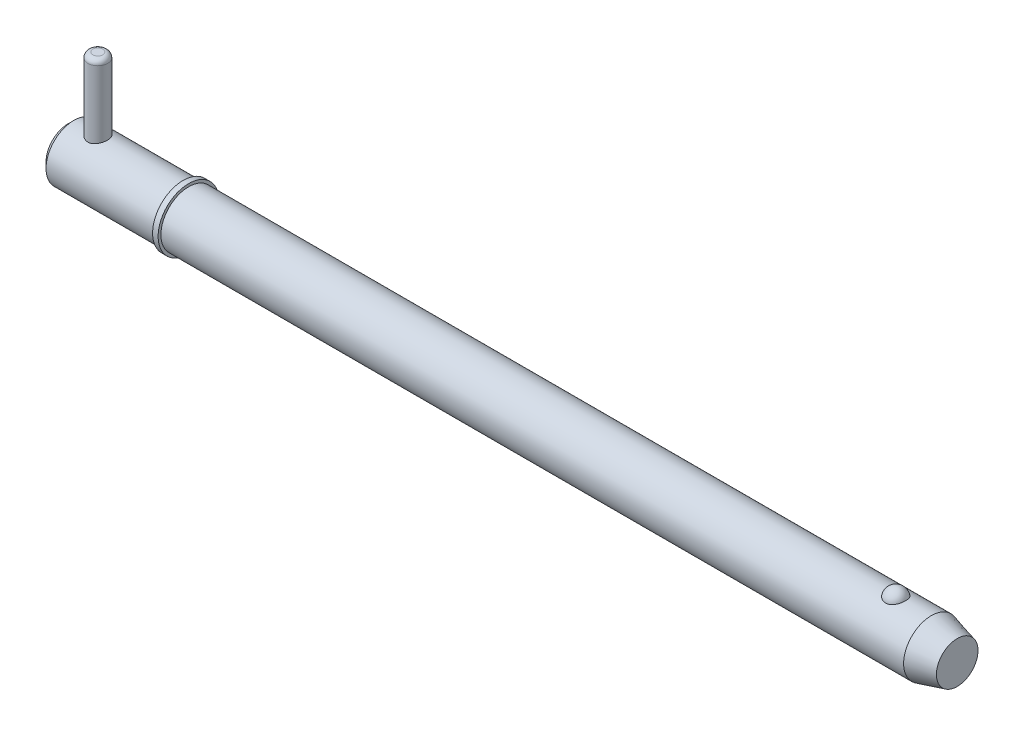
ISO-10303-21;
HEADER;
FILE_DESCRIPTION(('STEP AP214'),'2;1');
FILE_NAME('part.step','',(''),(''),'','','');
FILE_SCHEMA(('AUTOMOTIVE_DESIGN { 1 0 10303 214 1 1 1 1 }'));
ENDSEC;
DATA;
#1=APPLICATION_CONTEXT('core data for automotive mechanical design processes');
#2=APPLICATION_PROTOCOL_DEFINITION('international standard','automotive_design',2000,#1);
#3=PRODUCT_CONTEXT('',#1,'mechanical');
#4=PRODUCT('Part','Part','',(#3));
#5=PRODUCT_RELATED_PRODUCT_CATEGORY('part','',(#4));
#6=PRODUCT_DEFINITION_FORMATION('','',#4);
#7=PRODUCT_DEFINITION_CONTEXT('part definition',#1,'design');
#8=PRODUCT_DEFINITION('design','',#6,#7);
#9=PRODUCT_DEFINITION_SHAPE('','',#8);
#10=(LENGTH_UNIT() NAMED_UNIT(*) SI_UNIT(.MILLI.,.METRE.));
#11=(NAMED_UNIT(*) PLANE_ANGLE_UNIT() SI_UNIT($,.RADIAN.));
#12=(NAMED_UNIT(*) SI_UNIT($,.STERADIAN.) SOLID_ANGLE_UNIT());
#13=UNCERTAINTY_MEASURE_WITH_UNIT(LENGTH_MEASURE(1.E-05),#10,'distance_accuracy_value','');
#14=(GEOMETRIC_REPRESENTATION_CONTEXT(3) GLOBAL_UNCERTAINTY_ASSIGNED_CONTEXT((#13)) GLOBAL_UNIT_ASSIGNED_CONTEXT((#10,
#11,#12)) REPRESENTATION_CONTEXT('',''));
#15=CARTESIAN_POINT('',(0.,0.,0.));
#16=DIRECTION('',(0.,0.,1.));
#17=DIRECTION('',(1.,0.,0.));
#18=AXIS2_PLACEMENT_3D('',#15,#16,#17);
#19=CARTESIAN_POINT('',(5.94,19.845,0.));
#20=DIRECTION('',(0.,-1.,0.));
#21=DIRECTION('',(0.,0.,-1.));
#22=AXIS2_PLACEMENT_3D('',#19,#20,#21);
#23=CYLINDRICAL_SURFACE('',#22,1.98);
#24=CARTESIAN_POINT('',(5.94,-4.565,0.));
#25=DIRECTION('',(0.,1.,0.));
#26=DIRECTION('',(0.,0.,1.));
#27=AXIS2_PLACEMENT_3D('',#24,#25,#26);
#28=CIRCLE('',#27,1.98);
#29=CARTESIAN_POINT('',(5.94,-4.565,1.98));
#30=VERTEX_POINT('',#29);
#31=EDGE_CURVE('P0_E25',#30,#30,#28,.T.);
#32=ORIENTED_EDGE('',*,*,#31,.T.);
#33=EDGE_LOOP('',(#32));
#34=FACE_BOUND('',#33,.T.);
#35=CARTESIAN_POINT('',(5.94,18.855,0.));
#36=DIRECTION('',(0.,1.,0.));
#37=DIRECTION('',(0.,0.,1.));
#38=AXIS2_PLACEMENT_3D('',#35,#36,#37);
#39=CIRCLE('',#38,1.98);
#40=CARTESIAN_POINT('',(5.94,18.855,1.98));
#41=VERTEX_POINT('',#40);
#42=EDGE_CURVE('P0_E29',#41,#41,#39,.F.);
#43=ORIENTED_EDGE('',*,*,#42,.T.);
#44=EDGE_LOOP('',(#43));
#45=FACE_BOUND('',#44,.T.);
#46=ADVANCED_FACE('P0_F14',(#34,#45),#23,.T.);
#47=CARTESIAN_POINT('',(5.94,19.845,0.));
#48=DIRECTION('',(0.,1.,0.));
#49=DIRECTION('',(0.,0.,1.));
#50=AXIS2_PLACEMENT_3D('',#47,#48,#49);
#51=PLANE('',#50);
#52=CARTESIAN_POINT('',(5.94,19.845,0.));
#53=DIRECTION('',(0.,1.,0.));
#54=DIRECTION('',(0.,0.,1.));
#55=AXIS2_PLACEMENT_3D('',#52,#53,#54);
#56=CIRCLE('',#55,0.99);
#57=CARTESIAN_POINT('',(5.94,19.845,0.99));
#58=VERTEX_POINT('',#57);
#59=EDGE_CURVE('P0_E10',#58,#58,#56,.T.);
#60=ORIENTED_EDGE('',*,*,#59,.T.);
#61=EDGE_LOOP('',(#60));
#62=FACE_BOUND('',#61,.T.);
#63=ADVANCED_FACE('P0_F46',(#62),#51,.T.);
#64=CARTESIAN_POINT('',(5.94,-5.555,0.));
#65=DIRECTION('',(0.,1.,0.));
#66=DIRECTION('',(0.,0.,1.));
#67=AXIS2_PLACEMENT_3D('',#64,#65,#66);
#68=PLANE('',#67);
#69=CARTESIAN_POINT('',(5.94,-5.555,0.));
#70=DIRECTION('',(0.,1.,0.));
#71=DIRECTION('',(0.,0.,1.));
#72=AXIS2_PLACEMENT_3D('',#69,#70,#71);
#73=CIRCLE('',#72,0.99);
#74=CARTESIAN_POINT('',(5.94,-5.555,0.99));
#75=VERTEX_POINT('',#74);
#76=EDGE_CURVE('P0_E21',#75,#75,#73,.F.);
#77=ORIENTED_EDGE('',*,*,#76,.T.);
#78=EDGE_LOOP('',(#77));
#79=FACE_BOUND('',#78,.T.);
#80=ADVANCED_FACE('P0_F43',(#79),#68,.F.);
#81=CARTESIAN_POINT('',(5.94,-4.565,0.));
#82=DIRECTION('',(0.,1.,0.));
#83=DIRECTION('',(0.,0.,1.));
#84=AXIS2_PLACEMENT_3D('',#81,#82,#83);
#85=DEGENERATE_TOROIDAL_SURFACE('',#84,0.99,0.99,.T.);
#86=ORIENTED_EDGE('',*,*,#76,.F.);
#87=EDGE_LOOP('',(#86));
#88=FACE_BOUND('',#87,.T.);
#89=ORIENTED_EDGE('',*,*,#31,.F.);
#90=EDGE_LOOP('',(#89));
#91=FACE_BOUND('',#90,.T.);
#92=ADVANCED_FACE('P0_F38',(#88,#91),#85,.T.);
#93=CARTESIAN_POINT('',(5.94,18.855,0.));
#94=DIRECTION('',(0.,1.,0.));
#95=DIRECTION('',(0.,0.,1.));
#96=AXIS2_PLACEMENT_3D('',#93,#94,#95);
#97=DEGENERATE_TOROIDAL_SURFACE('',#96,0.99,0.99,.T.);
#98=ORIENTED_EDGE('',*,*,#42,.F.);
#99=EDGE_LOOP('',(#98));
#100=FACE_BOUND('',#99,.T.);
#101=ORIENTED_EDGE('',*,*,#59,.F.);
#102=EDGE_LOOP('',(#101));
#103=FACE_BOUND('',#102,.T.);
#104=ADVANCED_FACE('P0_F16',(#100,#103),#97,.T.);
#105=CLOSED_SHELL('',(#46,#63,#80,#92,#104));
#106=MANIFOLD_SOLID_BREP('P0_B1',#105);
#107=CARTESIAN_POINT('',(0.,0.,0.));
#108=DIRECTION('',(1.,0.,0.));
#109=DIRECTION('',(0.,0.,-1.));
#110=AXIS2_PLACEMENT_3D('',#107,#108,#109);
#111=CYLINDRICAL_SURFACE('',#110,5.555);
#112=CARTESIAN_POINT('',(172.917114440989,0.,0.));
#113=DIRECTION('',(1.,0.,0.));
#114=DIRECTION('',(0.,0.,-1.));
#115=AXIS2_PLACEMENT_3D('',#112,#113,#114);
#116=CIRCLE('',#115,5.555);
#117=CARTESIAN_POINT('',(172.917114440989,0.,-5.555));
#118=VERTEX_POINT('',#117);
#119=EDGE_CURVE('P1_E81',#118,#118,#116,.T.);
#120=ORIENTED_EDGE('',*,*,#119,.F.);
#121=EDGE_LOOP('',(#120));
#122=FACE_BOUND('',#121,.T.);
#123=CARTESIAN_POINT('',(24.13,0.,0.));
#124=DIRECTION('',(1.,0.,0.));
#125=DIRECTION('',(0.,0.,-1.));
#126=AXIS2_PLACEMENT_3D('',#123,#124,#125);
#127=CIRCLE('',#126,5.555);
#128=CARTESIAN_POINT('',(24.13,0.,-5.555));
#129=VERTEX_POINT('',#128);
#130=EDGE_CURVE('P1_E85',#129,#129,#127,.T.);
#131=ORIENTED_EDGE('',*,*,#130,.T.);
#132=EDGE_LOOP('',(#131));
#133=FACE_BOUND('',#132,.T.);
#134=CARTESIAN_POINT('',(165.798626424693,5.16741224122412,2.03859650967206));
#135=CARTESIAN_POINT('',(165.692949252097,5.16740893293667,2.03859990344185));
#136=CARTESIAN_POINT('',(165.58729894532,5.17079470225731,2.03008306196));
#137=CARTESIAN_POINT('',(165.379141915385,5.18392795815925,1.99630721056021));
#138=CARTESIAN_POINT('',(165.276634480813,5.19367399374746,1.97105201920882));
#139=CARTESIAN_POINT('',(165.077771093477,5.21839168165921,1.9046399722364));
#140=CARTESIAN_POINT('',(164.981406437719,5.23335573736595,1.8635062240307));
#141=CARTESIAN_POINT('',(164.797080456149,5.26688076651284,1.76652592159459));
#142=CARTESIAN_POINT('',(164.709120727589,5.28544242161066,1.71067657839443));
#143=CARTESIAN_POINT('',(164.541265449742,5.32479845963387,1.58399959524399));
#144=CARTESIAN_POINT('',(164.46166564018,5.34564089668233,1.51279545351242));
#145=CARTESIAN_POINT('',(164.31512901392,5.38697258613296,1.35828584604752));
#146=CARTESIAN_POINT('',(164.248194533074,5.40746177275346,1.27497815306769));
#147=CARTESIAN_POINT('',(164.12561039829,5.44694508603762,1.0944029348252));
#148=CARTESIAN_POINT('',(164.070598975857,5.46583143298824,0.996677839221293));
#149=CARTESIAN_POINT('',(163.976937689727,5.49908030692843,0.792961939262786));
#150=CARTESIAN_POINT('',(163.938289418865,5.513442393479,0.686970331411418));
#151=CARTESIAN_POINT('',(163.877680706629,5.53635851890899,0.468019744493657));
#152=CARTESIAN_POINT('',(163.855972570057,5.54482455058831,0.354981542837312));
#153=CARTESIAN_POINT('',(163.830636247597,5.55473324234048,0.12659586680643));
#154=CARTESIAN_POINT('',(163.827007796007,5.55617600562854,0.0112484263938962));
#155=CARTESIAN_POINT('',(163.837881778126,5.55189984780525,-0.218011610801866));
#156=CARTESIAN_POINT('',(163.852315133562,5.54620821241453,-0.331928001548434));
#157=CARTESIAN_POINT('',(163.898903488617,5.52828920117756,-0.555544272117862));
#158=CARTESIAN_POINT('',(163.931058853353,5.5160616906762,-0.665244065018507));
#159=CARTESIAN_POINT('',(164.012488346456,5.48630779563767,-0.877469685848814));
#160=CARTESIAN_POINT('',(164.061781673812,5.4687754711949,-0.979987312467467));
#161=CARTESIAN_POINT('',(164.176478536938,5.43024700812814,-1.17486975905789));
#162=CARTESIAN_POINT('',(164.241883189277,5.4092506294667,-1.26723387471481));
#163=CARTESIAN_POINT('',(164.387571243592,5.36600927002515,-1.4394013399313));
#164=CARTESIAN_POINT('',(164.467885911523,5.34376173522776,-1.51917763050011));
#165=CARTESIAN_POINT('',(164.641452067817,5.30057971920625,-1.66360338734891));
#166=CARTESIAN_POINT('',(164.734702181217,5.27964509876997,-1.72825445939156));
#167=CARTESIAN_POINT('',(164.929393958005,5.24205250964,-1.83909478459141));
#168=CARTESIAN_POINT('',(165.030590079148,5.22530519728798,-1.88568407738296));
#169=CARTESIAN_POINT('',(165.240155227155,5.19750919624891,-1.96100802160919));
#170=CARTESIAN_POINT('',(165.348521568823,5.1864583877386,-1.98974931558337));
#171=CARTESIAN_POINT('',(165.563498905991,5.17184410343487,-2.02742262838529));
#172=CARTESIAN_POINT('',(165.669925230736,5.1679328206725,-2.03727608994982));
#173=CARTESIAN_POINT('',(165.882992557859,5.16698995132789,-2.03966777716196));
#174=CARTESIAN_POINT('',(165.989633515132,5.16995704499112,-2.0322093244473));
#175=CARTESIAN_POINT('',(166.196773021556,5.18222383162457,-2.00071170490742));
#176=CARTESIAN_POINT('',(166.297359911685,5.19133213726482,-1.97717337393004));
#177=CARTESIAN_POINT('',(166.493014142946,5.21467637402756,-1.91475248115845));
#178=CARTESIAN_POINT('',(166.588081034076,5.22891272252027,-1.87586867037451));
#179=CARTESIAN_POINT('',(166.772371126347,5.26137066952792,-1.78282713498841));
#180=CARTESIAN_POINT('',(166.861419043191,5.27967329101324,-1.72835124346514));
#181=CARTESIAN_POINT('',(167.029288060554,5.3181741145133,-1.60597483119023));
#182=CARTESIAN_POINT('',(167.108106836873,5.33837274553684,-1.5380712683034));
#183=CARTESIAN_POINT('',(167.257515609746,5.37968287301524,-1.38688970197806));
#184=CARTESIAN_POINT('',(167.327505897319,5.40079011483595,-1.30301744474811));
#185=CARTESIAN_POINT('',(167.453012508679,5.44074401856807,-1.12458170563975));
#186=CARTESIAN_POINT('',(167.508526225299,5.45959027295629,-1.03001630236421));
#187=CARTESIAN_POINT('',(167.605550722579,5.49369849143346,-0.829439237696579));
#188=CARTESIAN_POINT('',(167.646548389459,5.50882422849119,-0.723155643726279));
#189=CARTESIAN_POINT('',(167.711125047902,5.53310911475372,-0.504772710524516));
#190=CARTESIAN_POINT('',(167.734703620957,5.54226812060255,-0.392673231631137));
#191=CARTESIAN_POINT('',(167.764013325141,5.55370358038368,-0.165459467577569));
#192=CARTESIAN_POINT('',(167.769688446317,5.55595843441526,-0.0503368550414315));
#193=CARTESIAN_POINT('',(167.762916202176,5.55329317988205,0.179288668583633));
#194=CARTESIAN_POINT('',(167.750469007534,5.54837313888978,0.293791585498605));
#195=CARTESIAN_POINT('',(167.707779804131,5.53189037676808,0.51852641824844));
#196=CARTESIAN_POINT('',(167.677598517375,5.5203503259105,0.62877154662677));
#197=CARTESIAN_POINT('',(167.600096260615,5.49182453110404,0.842318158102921));
#198=CARTESIAN_POINT('',(167.552774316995,5.47483847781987,0.945619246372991));
#199=CARTESIAN_POINT('',(167.441720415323,5.43710633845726,1.14281571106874));
#200=CARTESIAN_POINT('',(167.377921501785,5.41634501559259,1.23667048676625));
#201=CARTESIAN_POINT('',(167.235357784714,5.37334572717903,1.4118524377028));
#202=CARTESIAN_POINT('',(167.15659323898,5.35110778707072,1.49317982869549));
#203=CARTESIAN_POINT('',(166.986423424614,5.30779474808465,1.64049162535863));
#204=CARTESIAN_POINT('',(166.89510026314,5.28671324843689,1.70656877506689));
#205=CARTESIAN_POINT('',(166.701739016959,5.2480485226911,1.82201372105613));
#206=CARTESIAN_POINT('',(166.599700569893,5.23046541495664,1.87138095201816));
#207=CARTESIAN_POINT('',(166.383618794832,5.20042692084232,1.95335298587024));
#208=CARTESIAN_POINT('',(166.269260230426,5.18820192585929,1.98521734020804));
#209=CARTESIAN_POINT('',(166.036130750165,5.17169804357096,2.02783294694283));
#210=CARTESIAN_POINT('',(165.917361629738,5.16741595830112,2.03859269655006));
#211=CARTESIAN_POINT('',(165.798626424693,5.16741224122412,2.03859650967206));
#212=B_SPLINE_CURVE_WITH_KNOTS('',3,(#134,#135,#136,#137,#138,#139,#140,#141,#142,#143,#144,
#145,#146,#147,#148,#149,#150,#151,#152,#153,#154,#155,#156,#157,#158,#159,#160,#161,#162,#163,
#164,#165,#166,#167,#168,#169,#170,#171,#172,#173,#174,#175,#176,#177,#178,#179,#180,#181,#182,
#183,#184,#185,#186,#187,#188,#189,#190,#191,#192,#193,#194,#195,#196,#197,#198,#199,#200,#201,
#202,#203,#204,#205,#206,#207,#208,#209,#210,#211),.UNSPECIFIED.,.T.,.F.,(4,2,2,2,2,2,2,2,2,2,2,
2,2,2,2,2,2,2,2,2,2,2,2,2,2,2,2,2,2,2,2,2,2,2,2,2,2,2,4),(0.,0.316595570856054,
0.633118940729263,0.94918341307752,1.26530783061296,1.59030762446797,1.91536729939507,
2.25495824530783,2.59458224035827,2.93917283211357,3.28375835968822,3.62703002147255,
3.97030875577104,4.31397329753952,4.657661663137,5.00207904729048,5.34645984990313,
5.68270547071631,6.01882587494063,6.33808403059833,6.65728093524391,6.9669637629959,
7.27667180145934,7.59321535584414,7.90983070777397,8.24210387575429,8.57443684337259,
8.91755896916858,9.26068933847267,9.60489211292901,9.94909164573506,10.2921194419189,
10.6351667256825,10.9796305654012,11.3240884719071,11.6663928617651,12.0087088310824,
12.3645679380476,12.7202837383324),.UNSPECIFIED.);
#213=CARTESIAN_POINT('',(165.798626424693,5.16741224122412,2.03859650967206));
#214=VERTEX_POINT('',#213);
#215=EDGE_CURVE('P1_E35',#214,#214,#212,.T.);
#216=ORIENTED_EDGE('',*,*,#215,.T.);
#217=EDGE_LOOP('',(#216));
#218=FACE_BOUND('',#217,.T.);
#219=ADVANCED_FACE('P1_F13',(#122,#133,#218),#111,.T.);
#220=CARTESIAN_POINT('',(0.,0.,0.));
#221=DIRECTION('',(-1.,0.,0.));
#222=DIRECTION('',(0.,0.,1.));
#223=AXIS2_PLACEMENT_3D('',#220,#221,#222);
#224=PLANE('',#223);
#225=CARTESIAN_POINT('',(0.,0.,0.));
#226=DIRECTION('',(1.,0.,0.));
#227=DIRECTION('',(0.,0.,-1.));
#228=AXIS2_PLACEMENT_3D('',#225,#226,#227);
#229=CIRCLE('',#228,4.444);
#230=CARTESIAN_POINT('',(0.,0.,-4.444));
#231=VERTEX_POINT('',#230);
#232=EDGE_CURVE('P1_E9',#231,#231,#229,.T.);
#233=ORIENTED_EDGE('',*,*,#232,.F.);
#234=EDGE_LOOP('',(#233));
#235=FACE_BOUND('',#234,.T.);
#236=ADVANCED_FACE('P1_F15',(#235),#224,.T.);
#237=CARTESIAN_POINT('',(1.111,0.,0.));
#238=DIRECTION('',(1.,0.,0.));
#239=DIRECTION('',(0.,0.,-1.));
#240=AXIS2_PLACEMENT_3D('',#237,#238,#239);
#241=CONICAL_SURFACE('',#240,5.555,0.78539816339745);
#242=ORIENTED_EDGE('',*,*,#232,.T.);
#243=EDGE_LOOP('',(#242));
#244=FACE_BOUND('',#243,.T.);
#245=CARTESIAN_POINT('',(1.111,0.,0.));
#246=DIRECTION('',(1.,0.,0.));
#247=DIRECTION('',(0.,0.,-1.));
#248=AXIS2_PLACEMENT_3D('',#245,#246,#247);
#249=CIRCLE('',#248,5.555);
#250=CARTESIAN_POINT('',(1.111,0.,-5.555));
#251=VERTEX_POINT('',#250);
#252=EDGE_CURVE('P1_E26',#251,#251,#249,.T.);
#253=ORIENTED_EDGE('',*,*,#252,.F.);
#254=EDGE_LOOP('',(#253));
#255=FACE_BOUND('',#254,.T.);
#256=ADVANCED_FACE('P1_F77',(#244,#255),#241,.T.);
#257=CARTESIAN_POINT('',(0.,0.,0.));
#258=DIRECTION('',(1.,0.,0.));
#259=DIRECTION('',(0.,0.,-1.));
#260=AXIS2_PLACEMENT_3D('',#257,#258,#259);
#261=CYLINDRICAL_SURFACE('',#260,5.555);
#262=CARTESIAN_POINT('',(5.94,-5.19014691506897,1.98));
#263=CARTESIAN_POINT('',(5.83264687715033,-5.19014494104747,1.98000226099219));
#264=CARTESIAN_POINT('',(5.7253094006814,-5.19351395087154,1.97123988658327));
#265=CARTESIAN_POINT('',(5.51384517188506,-5.20654291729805,1.93656219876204));
#266=CARTESIAN_POINT('',(5.40971858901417,-5.21620320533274,1.91064598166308));
#267=CARTESIAN_POINT('',(5.20778082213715,-5.24058443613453,1.84271148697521));
#268=CARTESIAN_POINT('',(5.10995634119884,-5.25529427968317,1.80072850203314));
#269=CARTESIAN_POINT('',(4.92270352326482,-5.28810012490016,1.70197537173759));
#270=CARTESIAN_POINT('',(4.83327743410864,-5.3061970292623,1.64520128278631));
#271=CARTESIAN_POINT('',(4.66135184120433,-5.34464714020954,1.51575187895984));
#272=CARTESIAN_POINT('',(4.57928277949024,-5.36506222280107,1.44252311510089));
#273=CARTESIAN_POINT('',(4.42829115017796,-5.40532920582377,1.28342047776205));
#274=CARTESIAN_POINT('',(4.35937105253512,-5.42518099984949,1.19754423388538));
#275=CARTESIAN_POINT('',(4.23461605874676,-5.46281133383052,1.01237205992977));
#276=CARTESIAN_POINT('',(4.17924129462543,-5.48050875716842,0.912748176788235));
#277=CARTESIAN_POINT('',(4.0862117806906,-5.51109938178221,0.70485824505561));
#278=CARTESIAN_POINT('',(4.0485515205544,-5.52399407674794,0.596594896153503));
#279=CARTESIAN_POINT('',(3.99350662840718,-5.54308759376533,0.379019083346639));
#280=CARTESIAN_POINT('',(3.97538263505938,-5.54952987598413,0.269915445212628));
#281=CARTESIAN_POINT('',(3.95756405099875,-5.55586205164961,0.0500378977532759));
#282=CARTESIAN_POINT('',(3.95786404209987,-5.55575387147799,-0.060735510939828));
#283=CARTESIAN_POINT('',(3.97643665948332,-5.54915684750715,-0.275539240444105));
#284=CARTESIAN_POINT('',(3.99390415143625,-5.54295384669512,-0.379649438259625));
#285=CARTESIAN_POINT('',(4.0449721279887,-5.52523170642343,-0.583350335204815));
#286=CARTESIAN_POINT('',(4.07857373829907,-5.51371219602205,-0.682940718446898));
#287=CARTESIAN_POINT('',(4.16137312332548,-5.4863099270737,-0.876423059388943));
#288=CARTESIAN_POINT('',(4.2107826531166,-5.47036834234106,-0.970215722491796));
#289=CARTESIAN_POINT('',(4.32361427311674,-5.43575653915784,-1.1484017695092));
#290=CARTESIAN_POINT('',(4.38704062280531,-5.41708549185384,-1.23279228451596));
#291=CARTESIAN_POINT('',(4.53006791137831,-5.37778429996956,-1.39454579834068));
#292=CARTESIAN_POINT('',(4.61035105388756,-5.35710277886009,-1.4712940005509));
#293=CARTESIAN_POINT('',(4.78279835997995,-5.31692766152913,-1.6104545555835));
#294=CARTESIAN_POINT('',(4.874964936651,-5.29743430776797,-1.67286398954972));
#295=CARTESIAN_POINT('',(5.07076688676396,-5.26153775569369,-1.78259698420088));
#296=CARTESIAN_POINT('',(5.17458163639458,-5.24519780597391,-1.8296227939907));
#297=CARTESIAN_POINT('',(5.38938990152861,-5.21818744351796,-1.90530278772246));
#298=CARTESIAN_POINT('',(5.50037985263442,-5.20751423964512,-1.93396601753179));
#299=CARTESIAN_POINT('',(5.72036376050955,-5.19369176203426,-1.97077654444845));
#300=CARTESIAN_POINT('',(5.82917370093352,-5.19018851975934,-1.97989015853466));
#301=CARTESIAN_POINT('',(6.04680100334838,-5.19010609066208,-1.98010779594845));
#302=CARTESIAN_POINT('',(6.15561835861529,-5.19352540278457,-1.97121572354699));
#303=CARTESIAN_POINT('',(6.36548036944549,-5.20654623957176,-1.93654727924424));
#304=CARTESIAN_POINT('',(6.46666051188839,-5.21588705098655,-1.91148218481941));
#305=CARTESIAN_POINT('',(6.66334537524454,-5.23939939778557,-1.84605494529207));
#306=CARTESIAN_POINT('',(6.75884899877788,-5.25357186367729,-1.8056898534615));
#307=CARTESIAN_POINT('',(6.94517989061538,-5.28576258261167,-1.70921153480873));
#308=CARTESIAN_POINT('',(7.03572661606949,-5.30389804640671,-1.65259670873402));
#309=CARTESIAN_POINT('',(7.20638087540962,-5.34176077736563,-1.52577523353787));
#310=CARTESIAN_POINT('',(7.28648490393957,-5.36148857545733,-1.45556404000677));
#311=CARTESIAN_POINT('',(7.43864697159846,-5.40165494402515,-1.2988614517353));
#312=CARTESIAN_POINT('',(7.50999887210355,-5.42207106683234,-1.21167640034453));
#313=CARTESIAN_POINT('',(7.63712639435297,-5.46023601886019,-1.026066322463));
#314=CARTESIAN_POINT('',(7.69290228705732,-5.47798489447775,-0.927641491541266));
#315=CARTESIAN_POINT('',(7.78684673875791,-5.50876590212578,-0.722633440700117));
#316=CARTESIAN_POINT('',(7.82510508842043,-5.52182201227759,-0.616095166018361));
#317=CARTESIAN_POINT('',(7.88297051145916,-5.54184206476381,-0.397530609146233));
#318=CARTESIAN_POINT('',(7.90258540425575,-5.5488085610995,-0.285506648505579));
#319=CARTESIAN_POINT('',(7.9218262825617,-5.55564472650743,-0.065566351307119));
#320=CARTESIAN_POINT('',(7.92245987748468,-5.55587212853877,0.0422515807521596));
#321=CARTESIAN_POINT('',(7.90626329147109,-5.55011340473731,0.256387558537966));
#322=CARTESIAN_POINT('',(7.88943488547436,-5.54412791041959,0.362705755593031));
#323=CARTESIAN_POINT('',(7.83948457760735,-5.52676548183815,0.568649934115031));
#324=CARTESIAN_POINT('',(7.8067003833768,-5.51550046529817,0.668367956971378));
#325=CARTESIAN_POINT('',(7.72609369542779,-5.48874437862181,0.860911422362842));
#326=CARTESIAN_POINT('',(7.67826838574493,-5.47325251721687,0.953735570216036));
#327=CARTESIAN_POINT('',(7.56675024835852,-5.43884382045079,1.13391068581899));
#328=CARTESIAN_POINT('',(7.50249968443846,-5.41981485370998,1.22089468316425));
#329=CARTESIAN_POINT('',(7.36086495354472,-5.38069275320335,1.38316665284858));
#330=CARTESIAN_POINT('',(7.28347630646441,-5.36059925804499,1.45845061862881));
#331=CARTESIAN_POINT('',(7.11347587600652,-5.32048380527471,1.59876646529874));
#332=CARTESIAN_POINT('',(7.02032386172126,-5.30050854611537,1.66315951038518));
#333=CARTESIAN_POINT('',(6.82388804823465,-5.26398994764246,1.77536801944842));
#334=CARTESIAN_POINT('',(6.7206049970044,-5.24744635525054,1.82318470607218));
#335=CARTESIAN_POINT('',(6.50639706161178,-5.21987969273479,1.90068230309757));
#336=CARTESIAN_POINT('',(6.3954529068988,-5.20887116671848,1.93031547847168));
#337=CARTESIAN_POINT('',(6.16966522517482,-5.19400760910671,1.96996824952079));
#338=CARTESIAN_POINT('',(6.05482366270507,-5.19014902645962,1.97999758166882));
#339=CARTESIAN_POINT('',(5.94,-5.19014691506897,1.98));
#340=B_SPLINE_CURVE_WITH_KNOTS('',3,(#262,#263,#264,#265,#266,#267,#268,#269,#270,#271,#272,
#273,#274,#275,#276,#277,#278,#279,#280,#281,#282,#283,#284,#285,#286,#287,#288,#289,#290,#291,
#292,#293,#294,#295,#296,#297,#298,#299,#300,#301,#302,#303,#304,#305,#306,#307,#308,#309,#310,
#311,#312,#313,#314,#315,#316,#317,#318,#319,#320,#321,#322,#323,#324,#325,#326,#327,#328,#329,
#330,#331,#332,#333,#334,#335,#336,#337,#338,#339),.UNSPECIFIED.,.T.,.F.,(4,2,2,2,2,2,2,2,2,2,2,
2,2,2,2,2,2,2,2,2,2,2,2,2,2,2,2,2,2,2,2,2,2,2,2,2,2,2,4),(0.,0.321632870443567,
0.643282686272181,0.964229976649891,1.28526292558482,1.61937087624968,1.9535415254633,
2.29784481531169,2.64204093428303,2.97269632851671,3.30325448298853,3.61901541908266,
3.93479838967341,4.25500220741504,4.57530346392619,4.91268648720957,5.25013812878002,
5.59378026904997,5.93725299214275,6.26331481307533,6.58930593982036,6.90185604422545,
7.21446637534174,7.53801472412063,7.86167140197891,8.20353561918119,8.54539388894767,
8.88547970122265,9.22542281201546,9.54728637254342,9.86911722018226,10.1844146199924,
10.4997710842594,10.827730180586,11.1558013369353,11.499115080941,11.8424034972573,
12.1865892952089,12.5306041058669),.UNSPECIFIED.);
#341=CARTESIAN_POINT('',(5.94,-5.19014691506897,1.98));
#342=VERTEX_POINT('',#341);
#343=EDGE_CURVE('P1_E17',#342,#342,#340,.T.);
#344=ORIENTED_EDGE('',*,*,#343,.F.);
#345=EDGE_LOOP('',(#344));
#346=FACE_BOUND('',#345,.T.);
#347=CARTESIAN_POINT('',(5.94,5.19014691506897,1.98));
#348=CARTESIAN_POINT('',(6.04735312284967,5.19014494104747,1.98000226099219));
#349=CARTESIAN_POINT('',(6.1546905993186,5.19351395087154,1.97123988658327));
#350=CARTESIAN_POINT('',(6.36615482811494,5.20654291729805,1.93656219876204));
#351=CARTESIAN_POINT('',(6.47028141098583,5.21620320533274,1.91064598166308));
#352=CARTESIAN_POINT('',(6.67221917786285,5.24058443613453,1.84271148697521));
#353=CARTESIAN_POINT('',(6.77004365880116,5.25529427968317,1.80072850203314));
#354=CARTESIAN_POINT('',(6.95729647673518,5.28810012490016,1.70197537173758));
#355=CARTESIAN_POINT('',(7.04672256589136,5.3061970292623,1.64520128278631));
#356=CARTESIAN_POINT('',(7.21864815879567,5.34464714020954,1.51575187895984));
#357=CARTESIAN_POINT('',(7.30071722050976,5.36506222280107,1.44252311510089));
#358=CARTESIAN_POINT('',(7.45170884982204,5.40532920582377,1.28342047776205));
#359=CARTESIAN_POINT('',(7.52062894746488,5.42518099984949,1.19754423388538));
#360=CARTESIAN_POINT('',(7.64538394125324,5.46281133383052,1.01237205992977));
#361=CARTESIAN_POINT('',(7.70075870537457,5.48050875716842,0.912748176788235));
#362=CARTESIAN_POINT('',(7.7937882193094,5.51109938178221,0.704858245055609));
#363=CARTESIAN_POINT('',(7.8314484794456,5.52399407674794,0.596594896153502));
#364=CARTESIAN_POINT('',(7.88649337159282,5.54308759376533,0.379019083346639));
#365=CARTESIAN_POINT('',(7.90461736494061,5.54952987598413,0.269915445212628));
#366=CARTESIAN_POINT('',(7.92243594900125,5.55586205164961,0.0500378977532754));
#367=CARTESIAN_POINT('',(7.92213595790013,5.55575387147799,-0.0607355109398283));
#368=CARTESIAN_POINT('',(7.90356334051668,5.54915684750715,-0.275539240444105));
#369=CARTESIAN_POINT('',(7.88609584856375,5.54295384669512,-0.379649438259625));
#370=CARTESIAN_POINT('',(7.8350278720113,5.52523170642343,-0.583350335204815));
#371=CARTESIAN_POINT('',(7.80142626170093,5.51371219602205,-0.682940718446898));
#372=CARTESIAN_POINT('',(7.71862687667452,5.4863099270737,-0.876423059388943));
#373=CARTESIAN_POINT('',(7.6692173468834,5.47036834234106,-0.970215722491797));
#374=CARTESIAN_POINT('',(7.55638572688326,5.43575653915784,-1.1484017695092));
#375=CARTESIAN_POINT('',(7.49295937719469,5.41708549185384,-1.23279228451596));
#376=CARTESIAN_POINT('',(7.34993208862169,5.37778429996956,-1.39454579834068));
#377=CARTESIAN_POINT('',(7.26964894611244,5.35710277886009,-1.4712940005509));
#378=CARTESIAN_POINT('',(7.09720164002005,5.31692766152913,-1.6104545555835));
#379=CARTESIAN_POINT('',(7.00503506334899,5.29743430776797,-1.67286398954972));
#380=CARTESIAN_POINT('',(6.80923311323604,5.26153775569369,-1.78259698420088));
#381=CARTESIAN_POINT('',(6.70541836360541,5.24519780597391,-1.8296227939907));
#382=CARTESIAN_POINT('',(6.49061009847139,5.21818744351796,-1.90530278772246));
#383=CARTESIAN_POINT('',(6.37962014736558,5.20751423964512,-1.93396601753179));
#384=CARTESIAN_POINT('',(6.15963623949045,5.19369176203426,-1.97077654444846));
#385=CARTESIAN_POINT('',(6.05082629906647,5.19018851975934,-1.97989015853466));
#386=CARTESIAN_POINT('',(5.83319899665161,5.19010609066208,-1.98010779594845));
#387=CARTESIAN_POINT('',(5.7243816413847,5.19352540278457,-1.97121572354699));
#388=CARTESIAN_POINT('',(5.5145196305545,5.20654623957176,-1.93654727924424));
#389=CARTESIAN_POINT('',(5.4133394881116,5.21588705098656,-1.91148218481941));
#390=CARTESIAN_POINT('',(5.21665462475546,5.23939939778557,-1.84605494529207));
#391=CARTESIAN_POINT('',(5.12115100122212,5.25357186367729,-1.8056898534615));
#392=CARTESIAN_POINT('',(4.93482010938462,5.28576258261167,-1.70921153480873));
#393=CARTESIAN_POINT('',(4.84427338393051,5.30389804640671,-1.65259670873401));
#394=CARTESIAN_POINT('',(4.67361912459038,5.34176077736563,-1.52577523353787));
#395=CARTESIAN_POINT('',(4.59351509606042,5.36148857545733,-1.45556404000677));
#396=CARTESIAN_POINT('',(4.44135302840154,5.40165494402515,-1.2988614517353));
#397=CARTESIAN_POINT('',(4.37000112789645,5.42207106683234,-1.21167640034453));
#398=CARTESIAN_POINT('',(4.24287360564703,5.46023601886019,-1.026066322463));
#399=CARTESIAN_POINT('',(4.18709771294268,5.47798489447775,-0.927641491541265));
#400=CARTESIAN_POINT('',(4.09315326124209,5.50876590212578,-0.722633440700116));
#401=CARTESIAN_POINT('',(4.05489491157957,5.52182201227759,-0.61609516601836));
#402=CARTESIAN_POINT('',(3.99702948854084,5.54184206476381,-0.397530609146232));
#403=CARTESIAN_POINT('',(3.97741459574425,5.5488085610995,-0.285506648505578));
#404=CARTESIAN_POINT('',(3.9581737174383,5.55564472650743,-0.0655663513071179));
#405=CARTESIAN_POINT('',(3.95754012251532,5.55587212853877,0.0422515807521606));
#406=CARTESIAN_POINT('',(3.97373670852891,5.55011340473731,0.256387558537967));
#407=CARTESIAN_POINT('',(3.99056511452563,5.54412791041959,0.362705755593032));
#408=CARTESIAN_POINT('',(4.04051542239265,5.52676548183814,0.568649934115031));
#409=CARTESIAN_POINT('',(4.07329961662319,5.51550046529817,0.668367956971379));
#410=CARTESIAN_POINT('',(4.15390630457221,5.48874437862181,0.860911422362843));
#411=CARTESIAN_POINT('',(4.20173161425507,5.47325251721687,0.953735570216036));
#412=CARTESIAN_POINT('',(4.31324975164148,5.43884382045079,1.13391068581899));
#413=CARTESIAN_POINT('',(4.37750031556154,5.41981485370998,1.22089468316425));
#414=CARTESIAN_POINT('',(4.51913504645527,5.38069275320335,1.38316665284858));
#415=CARTESIAN_POINT('',(4.59652369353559,5.36059925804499,1.45845061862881));
#416=CARTESIAN_POINT('',(4.76652412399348,5.32048380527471,1.59876646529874));
#417=CARTESIAN_POINT('',(4.85967613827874,5.30050854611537,1.66315951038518));
#418=CARTESIAN_POINT('',(5.05611195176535,5.26398994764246,1.77536801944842));
#419=CARTESIAN_POINT('',(5.1593950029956,5.24744635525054,1.82318470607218));
#420=CARTESIAN_POINT('',(5.37360293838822,5.21987969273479,1.90068230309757));
#421=CARTESIAN_POINT('',(5.4845470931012,5.20887116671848,1.93031547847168));
#422=CARTESIAN_POINT('',(5.71033477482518,5.19400760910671,1.96996824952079));
#423=CARTESIAN_POINT('',(5.82517633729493,5.19014902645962,1.97999758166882));
#424=CARTESIAN_POINT('',(5.94,5.19014691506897,1.98));
#425=B_SPLINE_CURVE_WITH_KNOTS('',3,(#347,#348,#349,#350,#351,#352,#353,#354,#355,#356,#357,
#358,#359,#360,#361,#362,#363,#364,#365,#366,#367,#368,#369,#370,#371,#372,#373,#374,#375,#376,
#377,#378,#379,#380,#381,#382,#383,#384,#385,#386,#387,#388,#389,#390,#391,#392,#393,#394,#395,
#396,#397,#398,#399,#400,#401,#402,#403,#404,#405,#406,#407,#408,#409,#410,#411,#412,#413,#414,
#415,#416,#417,#418,#419,#420,#421,#422,#423,#424),.UNSPECIFIED.,.T.,.F.,(4,2,2,2,2,2,2,2,2,2,2,
2,2,2,2,2,2,2,2,2,2,2,2,2,2,2,2,2,2,2,2,2,2,2,2,2,2,2,4),(0.,0.321632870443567,
0.643282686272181,0.964229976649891,1.28526292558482,1.61937087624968,1.9535415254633,
2.29784481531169,2.64204093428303,2.97269632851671,3.30325448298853,3.61901541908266,
3.93479838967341,4.25500220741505,4.57530346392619,4.91268648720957,5.25013812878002,
5.59378026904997,5.93725299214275,6.26331481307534,6.58930593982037,6.90185604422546,
7.21446637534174,7.53801472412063,7.86167140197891,8.20353561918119,8.54539388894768,
8.88547970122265,9.22542281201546,9.54728637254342,9.86911722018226,10.1844146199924,
10.4997710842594,10.827730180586,11.1558013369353,11.499115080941,11.8424034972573,
12.1865892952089,12.5306041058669),.UNSPECIFIED.);
#426=CARTESIAN_POINT('',(5.94,5.19014691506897,1.98));
#427=VERTEX_POINT('',#426);
#428=EDGE_CURVE('P1_E43',#427,#427,#425,.T.);
#429=ORIENTED_EDGE('',*,*,#428,.F.);
#430=EDGE_LOOP('',(#429));
#431=FACE_BOUND('',#430,.T.);
#432=ORIENTED_EDGE('',*,*,#252,.T.);
#433=EDGE_LOOP('',(#432));
#434=FACE_BOUND('',#433,.T.);
#435=CARTESIAN_POINT('',(23.019,0.,0.));
#436=DIRECTION('',(1.,0.,0.));
#437=DIRECTION('',(0.,0.,-1.));
#438=AXIS2_PLACEMENT_3D('',#435,#436,#437);
#439=CIRCLE('',#438,5.555);
#440=CARTESIAN_POINT('',(23.019,0.,-5.555));
#441=VERTEX_POINT('',#440);
#442=EDGE_CURVE('P1_E31',#441,#441,#439,.T.);
#443=ORIENTED_EDGE('',*,*,#442,.F.);
#444=EDGE_LOOP('',(#443));
#445=FACE_BOUND('',#444,.T.);
#446=ADVANCED_FACE('P1_F103',(#346,#431,#434,#445),#261,.T.);
#447=CARTESIAN_POINT('',(23.019,5.555,0.));
#448=DIRECTION('',(-1.,0.,0.));
#449=DIRECTION('',(0.,0.,1.));
#450=AXIS2_PLACEMENT_3D('',#447,#448,#449);
#451=PLANE('',#450);
#452=ORIENTED_EDGE('',*,*,#442,.T.);
#453=EDGE_LOOP('',(#452));
#454=FACE_BOUND('',#453,.T.);
#455=CARTESIAN_POINT('',(23.019,0.,0.));
#456=DIRECTION('',(1.,0.,0.));
#457=DIRECTION('',(0.,0.,-1.));
#458=AXIS2_PLACEMENT_3D('',#455,#456,#457);
#459=CIRCLE('',#458,6.1105);
#460=CARTESIAN_POINT('',(23.019,0.,-6.1105));
#461=VERTEX_POINT('',#460);
#462=EDGE_CURVE('P1_E91',#461,#461,#459,.T.);
#463=ORIENTED_EDGE('',*,*,#462,.F.);
#464=EDGE_LOOP('',(#463));
#465=FACE_BOUND('',#464,.T.);
#466=ADVANCED_FACE('P1_F100',(#454,#465),#451,.T.);
#467=CARTESIAN_POINT('',(0.,0.,0.));
#468=DIRECTION('',(1.,0.,0.));
#469=DIRECTION('',(0.,0.,-1.));
#470=AXIS2_PLACEMENT_3D('',#467,#468,#469);
#471=CYLINDRICAL_SURFACE('',#470,6.1105);
#472=ORIENTED_EDGE('',*,*,#462,.T.);
#473=EDGE_LOOP('',(#472));
#474=FACE_BOUND('',#473,.T.);
#475=CARTESIAN_POINT('',(24.13,0.,0.));
#476=DIRECTION('',(1.,0.,0.));
#477=DIRECTION('',(0.,0.,-1.));
#478=AXIS2_PLACEMENT_3D('',#475,#476,#477);
#479=CIRCLE('',#478,6.1105);
#480=CARTESIAN_POINT('',(24.13,0.,-6.1105));
#481=VERTEX_POINT('',#480);
#482=EDGE_CURVE('P1_E88',#481,#481,#479,.T.);
#483=ORIENTED_EDGE('',*,*,#482,.F.);
#484=EDGE_LOOP('',(#483));
#485=FACE_BOUND('',#484,.T.);
#486=ADVANCED_FACE('P1_F68',(#474,#485),#471,.T.);
#487=CARTESIAN_POINT('',(24.13,6.1105,0.));
#488=DIRECTION('',(1.,0.,0.));
#489=DIRECTION('',(0.,0.,-1.));
#490=AXIS2_PLACEMENT_3D('',#487,#488,#489);
#491=PLANE('',#490);
#492=ORIENTED_EDGE('',*,*,#482,.T.);
#493=EDGE_LOOP('',(#492));
#494=FACE_BOUND('',#493,.T.);
#495=ORIENTED_EDGE('',*,*,#130,.F.);
#496=EDGE_LOOP('',(#495));
#497=FACE_BOUND('',#496,.T.);
#498=ADVANCED_FACE('P1_F62',(#494,#497),#491,.T.);
#499=CARTESIAN_POINT('',(178.1,0.,0.));
#500=DIRECTION('',(-1.,0.,0.));
#501=DIRECTION('',(0.,0.,1.));
#502=AXIS2_PLACEMENT_3D('',#499,#500,#501);
#503=CONICAL_SURFACE('',#502,4.16625000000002,0.26179938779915);
#504=ORIENTED_EDGE('',*,*,#119,.T.);
#505=EDGE_LOOP('',(#504));
#506=FACE_BOUND('',#505,.T.);
#507=CARTESIAN_POINT('',(178.1,0.,0.));
#508=DIRECTION('',(1.,0.,0.));
#509=DIRECTION('',(0.,0.,-1.));
#510=AXIS2_PLACEMENT_3D('',#507,#508,#509);
#511=CIRCLE('',#510,4.16625000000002);
#512=CARTESIAN_POINT('',(178.1,0.,-4.16625000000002));
#513=VERTEX_POINT('',#512);
#514=EDGE_CURVE('P1_E42',#513,#513,#511,.T.);
#515=ORIENTED_EDGE('',*,*,#514,.F.);
#516=EDGE_LOOP('',(#515));
#517=FACE_BOUND('',#516,.T.);
#518=ADVANCED_FACE('P1_F59',(#506,#517),#503,.T.);
#519=CARTESIAN_POINT('',(178.1,4.16625000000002,0.));
#520=DIRECTION('',(1.,0.,0.));
#521=DIRECTION('',(0.,0.,-1.));
#522=AXIS2_PLACEMENT_3D('',#519,#520,#521);
#523=PLANE('',#522);
#524=ORIENTED_EDGE('',*,*,#514,.T.);
#525=EDGE_LOOP('',(#524));
#526=FACE_BOUND('',#525,.T.);
#527=ADVANCED_FACE('P1_F55',(#526),#523,.T.);
#528=CARTESIAN_POINT('',(165.798626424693,4.9995,0.));
#529=DIRECTION('',(-1.,0.,0.));
#530=DIRECTION('',(0.,1.,0.));
#531=AXIS2_PLACEMENT_3D('',#528,#529,#530);
#532=SPHERICAL_SURFACE('',#531,2.04550000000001);
#533=ORIENTED_EDGE('',*,*,#215,.F.);
#534=EDGE_LOOP('',(#533));
#535=FACE_BOUND('',#534,.T.);
#536=ADVANCED_FACE('P1_F50',(#535),#532,.T.);
#537=CARTESIAN_POINT('',(5.94,-6.1105,0.));
#538=DIRECTION('',(0.,1.,0.));
#539=DIRECTION('',(0.,0.,1.));
#540=AXIS2_PLACEMENT_3D('',#537,#538,#539);
#541=CYLINDRICAL_SURFACE('',#540,1.98);
#542=ORIENTED_EDGE('',*,*,#343,.T.);
#543=EDGE_LOOP('',(#542));
#544=FACE_BOUND('',#543,.T.);
#545=ORIENTED_EDGE('',*,*,#428,.T.);
#546=EDGE_LOOP('',(#545));
#547=FACE_BOUND('',#546,.T.);
#548=ADVANCED_FACE('P1_F54',(#544,#547),#541,.F.);
#549=CLOSED_SHELL('',(#219,#236,#256,#446,#466,#486,#498,#518,#527,#536,#548));
#550=MANIFOLD_SOLID_BREP('P1_B1',#549);
#551=ADVANCED_BREP_SHAPE_REPRESENTATION('',(#18,#106,#550),#14);
#552=SHAPE_DEFINITION_REPRESENTATION(#9,#551);
ENDSEC;
END-ISO-10303-21;
